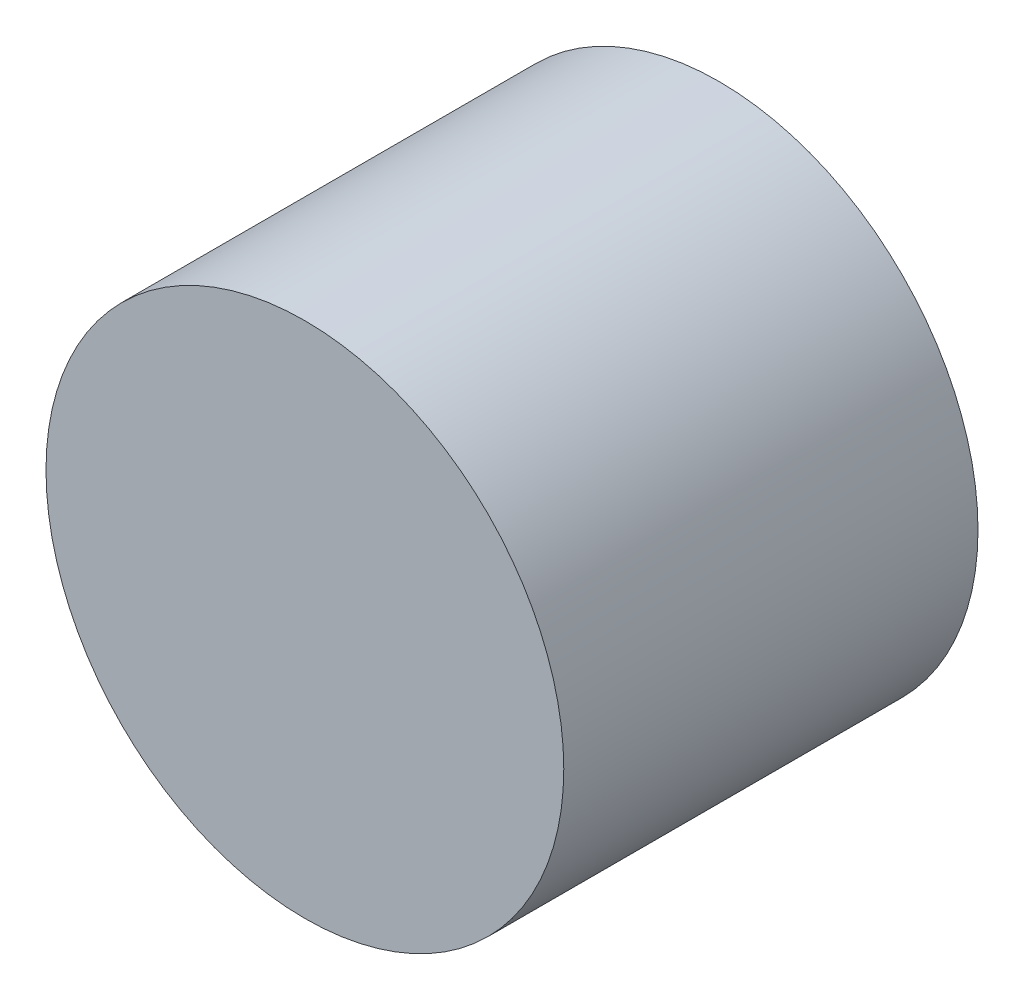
ISO-10303-21;
HEADER;
FILE_DESCRIPTION(('STEP AP214'),'2;1');
FILE_NAME('part.step','',(''),(''),'','','');
FILE_SCHEMA(('AUTOMOTIVE_DESIGN { 1 0 10303 214 1 1 1 1 }'));
ENDSEC;
DATA;
#1=APPLICATION_CONTEXT('core data for automotive mechanical design processes');
#2=APPLICATION_PROTOCOL_DEFINITION('international standard','automotive_design',2000,#1);
#3=PRODUCT_CONTEXT('',#1,'mechanical');
#4=PRODUCT('Part','Part','',(#3));
#5=PRODUCT_RELATED_PRODUCT_CATEGORY('part','',(#4));
#6=PRODUCT_DEFINITION_FORMATION('','',#4);
#7=PRODUCT_DEFINITION_CONTEXT('part definition',#1,'design');
#8=PRODUCT_DEFINITION('design','',#6,#7);
#9=PRODUCT_DEFINITION_SHAPE('','',#8);
#10=(LENGTH_UNIT() NAMED_UNIT(*) SI_UNIT(.MILLI.,.METRE.));
#11=(NAMED_UNIT(*) PLANE_ANGLE_UNIT() SI_UNIT($,.RADIAN.));
#12=(NAMED_UNIT(*) SI_UNIT($,.STERADIAN.) SOLID_ANGLE_UNIT());
#13=UNCERTAINTY_MEASURE_WITH_UNIT(LENGTH_MEASURE(1.E-05),#10,'distance_accuracy_value','');
#14=(GEOMETRIC_REPRESENTATION_CONTEXT(3) GLOBAL_UNCERTAINTY_ASSIGNED_CONTEXT((#13)) GLOBAL_UNIT_ASSIGNED_CONTEXT((#10,
#11,#12)) REPRESENTATION_CONTEXT('',''));
#15=CARTESIAN_POINT('',(0.,0.,0.));
#16=DIRECTION('',(0.,0.,1.));
#17=DIRECTION('',(1.,0.,0.));
#18=AXIS2_PLACEMENT_3D('',#15,#16,#17);
#19=CARTESIAN_POINT('',(2.,0.,0.));
#20=DIRECTION('',(0.,0.,-1.));
#21=DIRECTION('',(-1.,0.,0.));
#22=AXIS2_PLACEMENT_3D('',#19,#20,#21);
#23=PLANE('',#22);
#24=CARTESIAN_POINT('',(0.,0.,0.));
#25=DIRECTION('',(0.,0.,-1.));
#26=DIRECTION('',(-1.,0.,0.));
#27=AXIS2_PLACEMENT_3D('',#24,#25,#26);
#28=CIRCLE('',#27,2.);
#29=CARTESIAN_POINT('',(-2.,0.,0.));
#30=VERTEX_POINT('',#29);
#31=EDGE_CURVE('E18',#30,#30,#28,.F.);
#32=ORIENTED_EDGE('',*,*,#31,.F.);
#33=EDGE_LOOP('',(#32));
#34=FACE_BOUND('',#33,.T.);
#35=ADVANCED_FACE('F15',(#34),#23,.T.);
#36=CARTESIAN_POINT('',(2.,0.,3.2));
#37=DIRECTION('',(0.,0.,-1.));
#38=DIRECTION('',(-1.,0.,0.));
#39=AXIS2_PLACEMENT_3D('',#36,#37,#38);
#40=PLANE('',#39);
#41=CARTESIAN_POINT('',(0.,0.,3.2));
#42=DIRECTION('',(0.,0.,-1.));
#43=DIRECTION('',(-1.,0.,0.));
#44=AXIS2_PLACEMENT_3D('',#41,#42,#43);
#45=CIRCLE('',#44,2.);
#46=CARTESIAN_POINT('',(-2.,0.,3.2));
#47=VERTEX_POINT('',#46);
#48=EDGE_CURVE('E10',#47,#47,#45,.T.);
#49=ORIENTED_EDGE('',*,*,#48,.F.);
#50=EDGE_LOOP('',(#49));
#51=FACE_BOUND('',#50,.T.);
#52=ADVANCED_FACE('F30',(#51),#40,.F.);
#53=CARTESIAN_POINT('',(0.,0.,0.));
#54=DIRECTION('',(0.,0.,-1.));
#55=DIRECTION('',(-1.,0.,0.));
#56=AXIS2_PLACEMENT_3D('',#53,#54,#55);
#57=CYLINDRICAL_SURFACE('',#56,2.);
#58=ORIENTED_EDGE('',*,*,#31,.T.);
#59=EDGE_LOOP('',(#58));
#60=FACE_BOUND('',#59,.T.);
#61=ORIENTED_EDGE('',*,*,#48,.T.);
#62=EDGE_LOOP('',(#61));
#63=FACE_BOUND('',#62,.T.);
#64=ADVANCED_FACE('F27',(#60,#63),#57,.T.);
#65=CLOSED_SHELL('',(#35,#52,#64));
#66=MANIFOLD_SOLID_BREP('B1',#65);
#67=ADVANCED_BREP_SHAPE_REPRESENTATION('',(#18,#66),#14);
#68=SHAPE_DEFINITION_REPRESENTATION(#9,#67);
ENDSEC;
END-ISO-10303-21;
